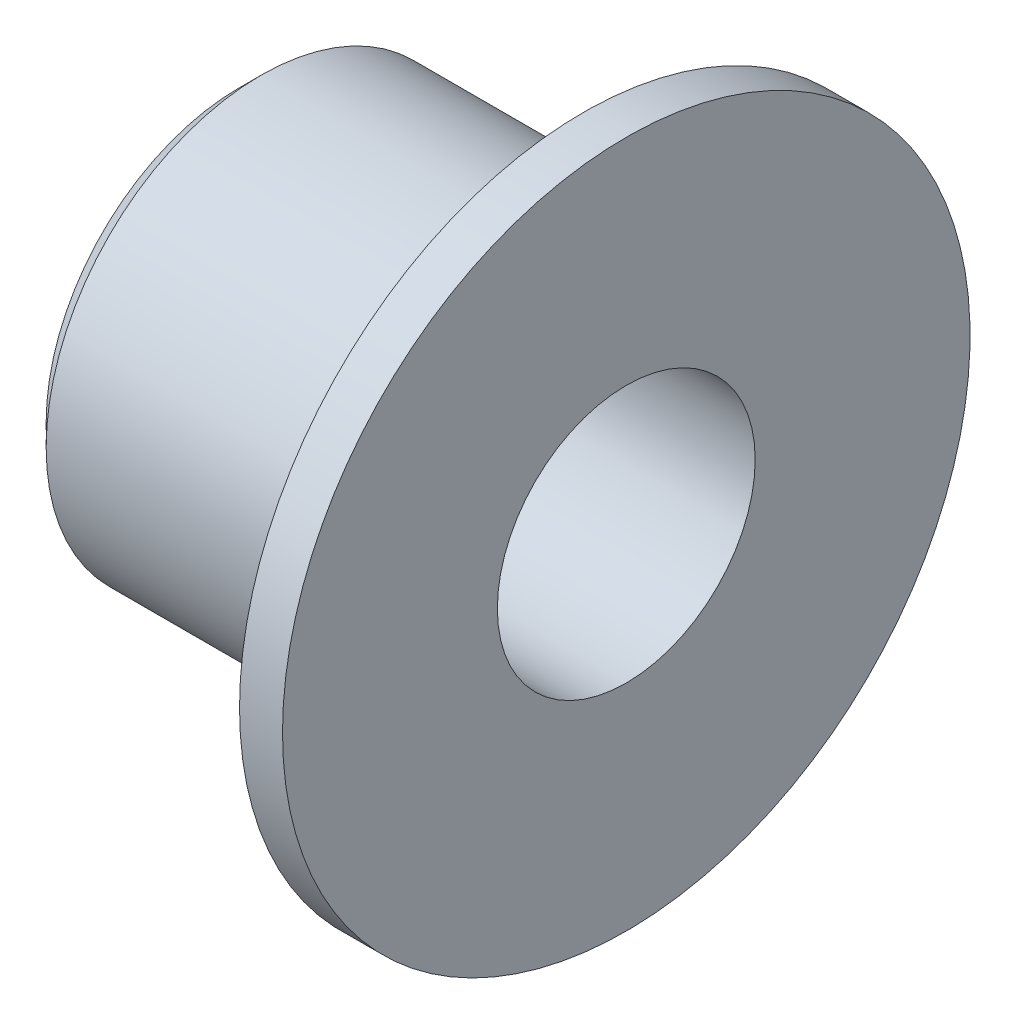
from build123d import *

# Parameters (mm, degrees)
CHANFREIN1_SIZE = 0.5


with BuildPart() as part:
    # Esquisse1 → R_volution1 (revolve)
    with BuildSketch(Plane.XY, mode=Mode.PRIVATE) as r_volution1_sk:
        Polygon((0, 3), (0, 5), (8, 5), (8, 8), (9, 8), (9, 3), align=None)
    revolve(r_volution1_sk.sketch.rotate(Axis((0, 0, 0), (1, 0, 0)), 90), axis=Axis((0, 0, 0), (1, 0, 0)))

    # Chanfrein1
    chanfrein1_edges = [part.edges().sort_by_distance(p)[0] for p in [
        (0, 0, -5),
    ]]
    chamfer(chanfrein1_edges, length=CHANFREIN1_SIZE)


solid = part.part
